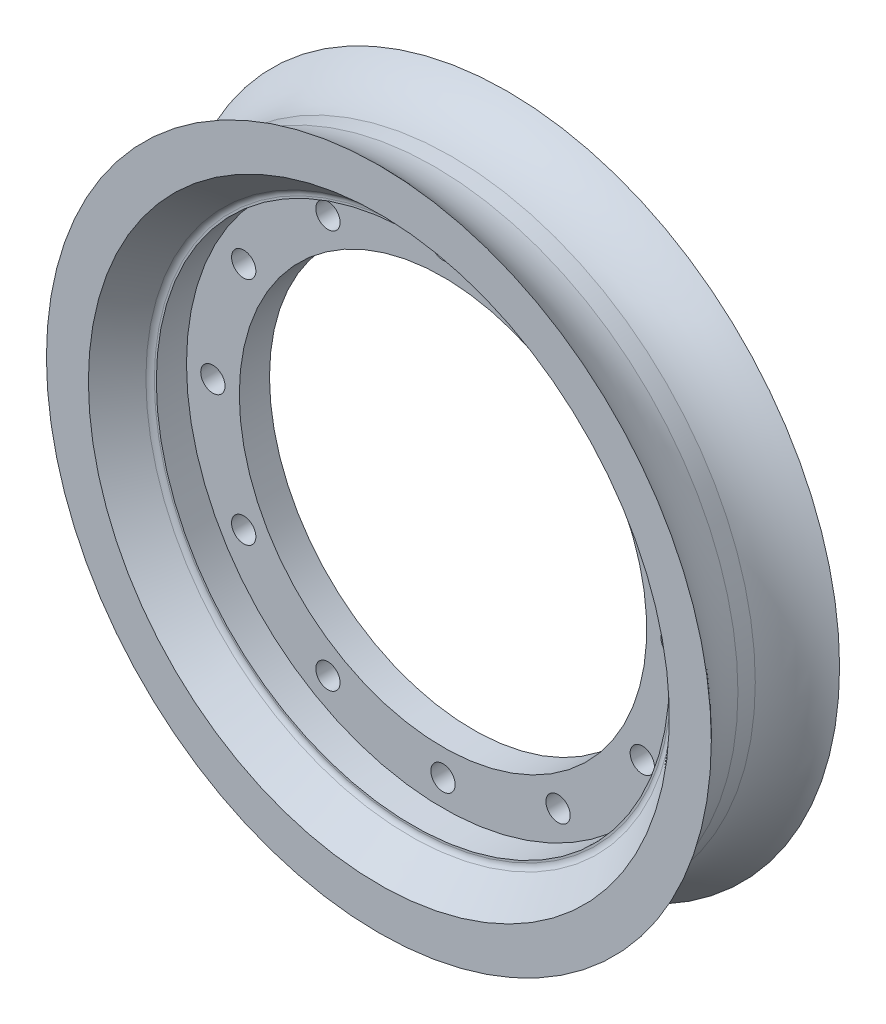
from build123d import *

# Parameters (mm, degrees)
ESQUISSE1_R                  = 201.2085
BASE_EXTRUSION_DEPTH         = 42.5
ENL_V_MAT_EXTRU_2_DEPTH      = 315.444873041
ENL_V_MAT_EXTRU_2_DEPTH_BACK = 315.444873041
ESQUISSE4_R                  = 135
ESQUISSE21_R                 = 8.05
ENL_V_MAT_EXTRU_3_DEPTH      = 318.766546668


with BuildPart() as part:
    # Esquisse1 → Base-Extrusion (new, symmetric)
    with BuildSketch(Plane.XY):
        Circle(ESQUISSE1_R)
    extrude(amount=BASE_EXTRUSION_DEPTH, both=True)

    # Esquisse6 → Boss.-R_vol.1 (revolve)
    with BuildSketch(Plane(origin=(0, 0, 0), x_dir=(-0.9995500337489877, -0.02999550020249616, 0), z_dir=(-0.02999550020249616, 0.9995500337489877, 0)), mode=Mode.PRIVATE) as boss_r_vol_1_sk:
        with BuildLine():
            Line((-201.2085, 42.5), (-220.305842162, 42.5))
            ThreePointArc((-220.305842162, 42.5), (-200.914042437, 0), (-220.305842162, -42.5))
            Line((-220.305842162, -42.5), (-201.2085, -42.5))
            Line((-201.2085, -42.5), (-200.2085, -42.5))
            Line((-200.2085, -42.5), (-200.2085, 42.5))
            Line((-200.2085, 42.5), (-201.2085, 42.5))
        make_face()
    revolve(boss_r_vol_1_sk.sketch.rotate(Axis((0, 0, 0), (0, 0, 1)), 178.281126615), axis=Axis((0, 0, 0), (0, 0, 1)))

    # Esquisse4 → Enl_v. mat.-Extru.2 (cut, two sides: drawn at the far end of the back side and taken through both)
    with BuildSketch(Plane.XY.offset(-ENL_V_MAT_EXTRU_2_DEPTH_BACK)):
        Circle(ESQUISSE4_R)
    extrude(amount=ENL_V_MAT_EXTRU_2_DEPTH + ENL_V_MAT_EXTRU_2_DEPTH_BACK, mode=Mode.SUBTRACT)

    # Esquisse19 → Finition N_2 (revolve, cut)
    with BuildSketch(Plane(origin=(0, 0, 0), x_dir=(-0.9995500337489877, -0.02999550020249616, 0), z_dir=(-0.02999550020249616, 0.9995500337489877, 0)), mode=Mode.PRIVATE) as finition_n_2_sk:
        with BuildLine():
            Line((0, 97.2679768), (-276.890034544, 97.2679768))
            Line((-276.890034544, 97.2679768), (-276.890034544, -109.579593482))
            Line((-276.890034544, -109.579593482), (0, -109.579593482))
            Line((0, -109.579593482), (0, -42.5))
            Line((0, -42.5), (-222, -42.5))
            ThreePointArc((-222, -42.5), (-224.121320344, -41.621320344), (-225, -39.5))
            Line((-225, -39.5), (-225, 39.5))
            ThreePointArc((-225, 39.5), (-224.121320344, 41.621320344), (-222, 42.5))
            Line((-222, 42.5), (0, 42.5))
            Line((0, 42.5), (0, 97.2679768))
        make_face()
    revolve(finition_n_2_sk.sketch.rotate(Axis((0, 0, 42.5), (0, 0, -1)), 181.718873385), axis=Axis((0, 0, 42.5), (0, 0, -1)), mode=Mode.SUBTRACT)

    # Esquisse20 → Enl_vement de mati_re-R_volution1 (revolve, cut)
    with BuildSketch(Plane(origin=(0, 0, 0), x_dir=(1, 0, 0), z_dir=(0, 1, 0)), mode=Mode.PRIVATE) as enl_vement_de_mati_re_r_volution1_sk:
        with BuildLine():
            Line((135, 0), (170, 0))
            Line((170, 0), (170, -20))
            Line((170, -20), (171.288720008, -20))
            ThreePointArc((171.288720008, -20), (173.401811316, -20.468461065), (175.118942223, -21.786061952))
            Line((175.118942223, -21.786061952), (192.5, -42.5))
            Line((192.5, -42.5), (51.352103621, -42.5))
            Line((51.352103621, -42.5), (51.352103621, 42.5))
            Line((51.352103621, 42.5), (192.5, 42.5))
            Line((192.5, 42.5), (175.118942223, 21.786061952))
            ThreePointArc((175.118942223, 21.786061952), (173.401811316, 20.468461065), (171.288720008, 20))
            Line((171.288720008, 20), (135, 20))
            Line((135, 20), (135, 0))
        make_face()
    revolve(enl_vement_de_mati_re_r_volution1_sk.sketch.rotate(Axis((0, 0, -131.640619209), (0, 0, 1)), 180), axis=Axis((0, 0, -131.640619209), (0, 0, 1)), mode=Mode.SUBTRACT)

    # Esquisse21 → Enl_v. mat.-Extru.3 (cut, through all)
    with BuildSketch(Plane(origin=(0, 0, -20), x_dir=(-1, 0, 0), z_dir=(0, 0, -1))):
        with Locations((0, 152.5)):
            Circle(ESQUISSE21_R)
        with Locations((76.25, 132.068874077)):
            Circle(ESQUISSE21_R)
        with Locations((132.068874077, 76.25)):
            Circle(ESQUISSE21_R)
        with Locations((152.5, 0)):
            Circle(ESQUISSE21_R)
        with Locations((132.068874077, -76.25)):
            Circle(ESQUISSE21_R)
        with Locations((76.25, -132.068874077)):
            Circle(ESQUISSE21_R)
        with Locations((0, -152.5)):
            Circle(ESQUISSE21_R)
        with Locations((-76.25, -132.068874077)):
            Circle(ESQUISSE21_R)
        with Locations((-132.068874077, -76.25)):
            Circle(ESQUISSE21_R)
        with Locations((-152.5, 0)):
            Circle(ESQUISSE21_R)
        with Locations((-132.068874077, 76.25)):
            Circle(ESQUISSE21_R)
        with Locations((-76.25, 132.068874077)):
            Circle(ESQUISSE21_R)
    extrude(amount=-ENL_V_MAT_EXTRU_3_DEPTH, mode=Mode.SUBTRACT)


solid = part.part
